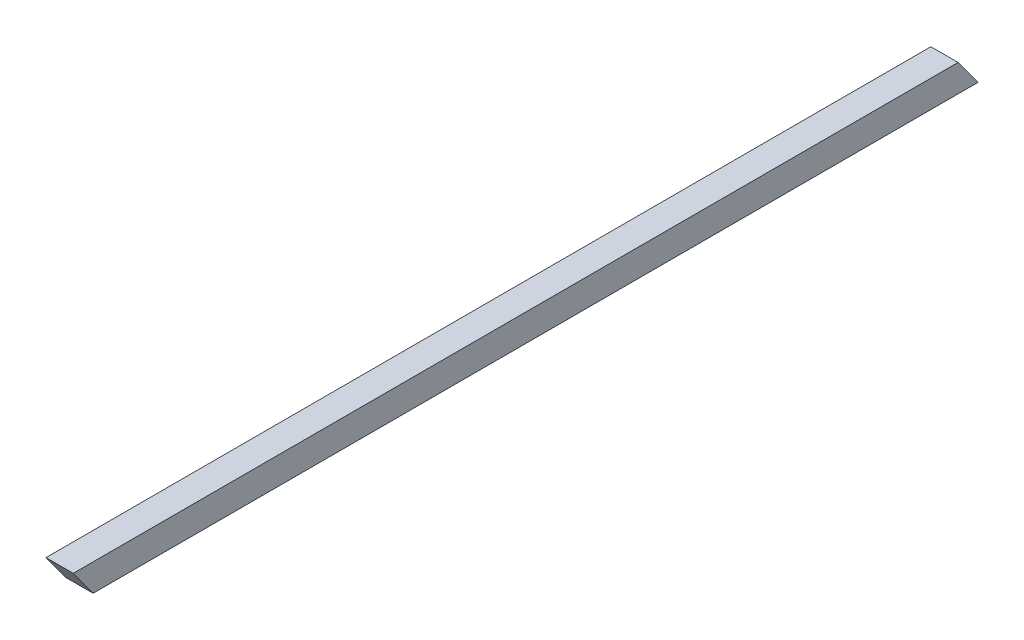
from build123d import *

# Parameters (mm, degrees)
ESQUISSE1_W             = 4
ESQUISSE1_H             = 4
EXTRUSION1_DEPTH        = 65
ENL_V_MAT_EXTRU_1_DEPTH = 300
EXTRUSION2_DEPTH        = 4


with BuildPart() as part:
    # Esquisse1 → Extrusion1 (new, symmetric)
    with BuildSketch(Plane.XY):
        Rectangle(ESQUISSE1_W, ESQUISSE1_H)
    extrude(amount=EXTRUSION1_DEPTH, both=True)

    # Esquisse2 → Enl_v. mat.-Extru.1 (cut)
    with BuildSketch(Plane.ZY.offset(2)):
        Polygon((-65, -2), (-62.076528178, 2), (-65, 2), align=None)
    extrude(amount=-ENL_V_MAT_EXTRU_1_DEPTH, mode=Mode.SUBTRACT)

    # Esquisse3 → Extrusion2 (add)
    with BuildSketch(Plane.ZY.offset(2)):
        Polygon((65, 2), (65, -2), (67.923471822, 2), align=None)
    extrude(amount=-EXTRUSION2_DEPTH)


solid = part.part
